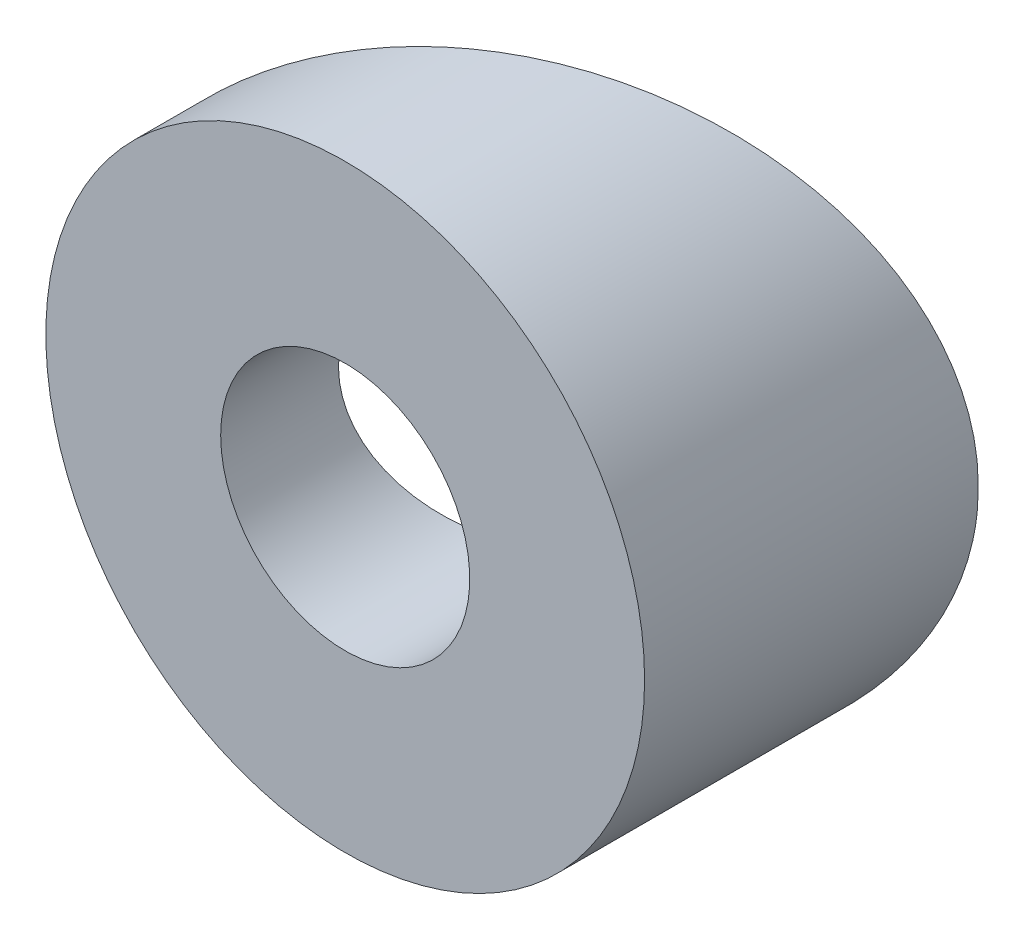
ISO-10303-21;
HEADER;
FILE_DESCRIPTION(('STEP AP214'),'2;1');
FILE_NAME('part.step','',(''),(''),'','','');
FILE_SCHEMA(('AUTOMOTIVE_DESIGN { 1 0 10303 214 1 1 1 1 }'));
ENDSEC;
DATA;
#1=APPLICATION_CONTEXT('core data for automotive mechanical design processes');
#2=APPLICATION_PROTOCOL_DEFINITION('international standard','automotive_design',2000,#1);
#3=PRODUCT_CONTEXT('',#1,'mechanical');
#4=PRODUCT('Part','Part','',(#3));
#5=PRODUCT_RELATED_PRODUCT_CATEGORY('part','',(#4));
#6=PRODUCT_DEFINITION_FORMATION('','',#4);
#7=PRODUCT_DEFINITION_CONTEXT('part definition',#1,'design');
#8=PRODUCT_DEFINITION('design','',#6,#7);
#9=PRODUCT_DEFINITION_SHAPE('','',#8);
#10=(LENGTH_UNIT() NAMED_UNIT(*) SI_UNIT(.MILLI.,.METRE.));
#11=(NAMED_UNIT(*) PLANE_ANGLE_UNIT() SI_UNIT($,.RADIAN.));
#12=(NAMED_UNIT(*) SI_UNIT($,.STERADIAN.) SOLID_ANGLE_UNIT());
#13=UNCERTAINTY_MEASURE_WITH_UNIT(LENGTH_MEASURE(1.E-05),#10,'distance_accuracy_value','');
#14=(GEOMETRIC_REPRESENTATION_CONTEXT(3) GLOBAL_UNCERTAINTY_ASSIGNED_CONTEXT((#13)) GLOBAL_UNIT_ASSIGNED_CONTEXT((#10,
#11,#12)) REPRESENTATION_CONTEXT('',''));
#15=CARTESIAN_POINT('',(0.,0.,0.));
#16=DIRECTION('',(0.,0.,1.));
#17=DIRECTION('',(1.,0.,0.));
#18=AXIS2_PLACEMENT_3D('',#15,#16,#17);
#19=CARTESIAN_POINT('',(0.,0.,0.));
#20=DIRECTION('',(0.,0.,-1.));
#21=DIRECTION('',(1.,0.,0.));
#22=AXIS2_PLACEMENT_3D('',#19,#20,#21);
#23=CYLINDRICAL_SURFACE('',#22,7.9375);
#24=CARTESIAN_POINT('',(0.,0.,3.27061794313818));
#25=DIRECTION('',(0.453990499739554,0.,0.891006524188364));
#26=DIRECTION('',(0.891006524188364,0.,-0.453990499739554));
#27=AXIS2_PLACEMENT_3D('',#24,#25,#26);
#28=ELLIPSE('',#27,8.90846451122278,7.9375);
#29=CARTESIAN_POINT('',(7.91445833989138,-0.604363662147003,-0.761999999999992));
#30=VERTEX_POINT('',#29);
#31=CARTESIAN_POINT('',(7.91445833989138,0.604363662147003,-0.761999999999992));
#32=VERTEX_POINT('',#31);
#33=EDGE_CURVE('E57',#30,#32,#28,.F.);
#34=ORIENTED_EDGE('',*,*,#33,.F.);
#35=CARTESIAN_POINT('',(0.,0.,-0.761999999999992));
#36=DIRECTION('',(0.,0.,1.));
#37=DIRECTION('',(1.,0.,0.));
#38=AXIS2_PLACEMENT_3D('',#35,#36,#37);
#39=CIRCLE('',#38,7.9375);
#40=EDGE_CURVE('E51',#30,#32,#39,.T.);
#41=ORIENTED_EDGE('',*,*,#40,.T.);
#42=EDGE_LOOP('',(#34,#41));
#43=FACE_BOUND('',#42,.T.);
#44=CARTESIAN_POINT('',(0.,0.,8.07720000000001));
#45=DIRECTION('',(0.,0.,-1.));
#46=DIRECTION('',(1.,0.,0.));
#47=AXIS2_PLACEMENT_3D('',#44,#45,#46);
#48=CIRCLE('',#47,7.9375);
#49=CARTESIAN_POINT('',(7.9375,0.,8.07720000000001));
#50=VERTEX_POINT('',#49);
#51=EDGE_CURVE('E12',#50,#50,#48,.T.);
#52=ORIENTED_EDGE('',*,*,#51,.T.);
#53=EDGE_LOOP('',(#52));
#54=FACE_BOUND('',#53,.T.);
#55=ADVANCED_FACE('F43',(#43,#54),#23,.T.);
#56=CARTESIAN_POINT('',(0.597787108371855,0.,8.07720000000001));
#57=DIRECTION('',(0.,0.,1.));
#58=DIRECTION('',(1.,0.,0.));
#59=AXIS2_PLACEMENT_3D('',#56,#57,#58);
#60=PLANE('',#59);
#61=CARTESIAN_POINT('',(0.,0.,8.07720000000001));
#62=DIRECTION('',(0.,0.,-1.));
#63=DIRECTION('',(-1.,0.,0.));
#64=AXIS2_PLACEMENT_3D('',#61,#62,#63);
#65=CIRCLE('',#64,3.30199999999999);
#66=CARTESIAN_POINT('',(-3.30199999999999,0.,8.07720000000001));
#67=VERTEX_POINT('',#66);
#68=EDGE_CURVE('E70',#67,#67,#65,.T.);
#69=ORIENTED_EDGE('',*,*,#68,.T.);
#70=EDGE_LOOP('',(#69));
#71=FACE_BOUND('',#70,.T.);
#72=ORIENTED_EDGE('',*,*,#51,.F.);
#73=EDGE_LOOP('',(#72));
#74=FACE_BOUND('',#73,.T.);
#75=ADVANCED_FACE('F88',(#71,#74),#60,.T.);
#76=CARTESIAN_POINT('',(0.,0.,-0.761999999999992));
#77=DIRECTION('',(0.,0.,1.));
#78=DIRECTION('',(1.,0.,0.));
#79=AXIS2_PLACEMENT_3D('',#76,#77,#78);
#80=PLANE('',#79);
#81=ORIENTED_EDGE('',*,*,#40,.F.);
#82=DIRECTION('',(0.,-1.,0.));
#83=VECTOR('',#82,1.);
#84=CARTESIAN_POINT('',(7.91445833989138,0.,-0.761999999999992));
#85=LINE('',#84,#83);
#86=EDGE_CURVE('E59',#32,#30,#85,.T.);
#87=ORIENTED_EDGE('',*,*,#86,.F.);
#88=EDGE_LOOP('',(#81,#87));
#89=FACE_BOUND('',#88,.T.);
#90=ADVANCED_FACE('F69',(#89),#80,.F.);
#91=CARTESIAN_POINT('',(0.,0.,-0.761999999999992));
#92=DIRECTION('',(0.,0.,-1.));
#93=DIRECTION('',(-1.,0.,0.));
#94=AXIS2_PLACEMENT_3D('',#91,#92,#93);
#95=CYLINDRICAL_SURFACE('',#94,3.30199999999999);
#96=CARTESIAN_POINT('',(0.,0.,3.27061794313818));
#97=DIRECTION('',(0.453990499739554,0.,0.891006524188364));
#98=DIRECTION('',(0.891006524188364,0.,-0.453990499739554));
#99=AXIS2_PLACEMENT_3D('',#96,#97,#98);
#100=ELLIPSE('',#99,3.70592123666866,3.30199999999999);
#101=CARTESIAN_POINT('',(3.30199999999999,0.,1.58816490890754));
#102=VERTEX_POINT('',#101);
#103=EDGE_CURVE('E46',#102,#102,#100,.F.);
#104=ORIENTED_EDGE('',*,*,#103,.T.);
#105=EDGE_LOOP('',(#104));
#106=FACE_BOUND('',#105,.T.);
#107=ORIENTED_EDGE('',*,*,#68,.F.);
#108=EDGE_LOOP('',(#107));
#109=FACE_BOUND('',#108,.T.);
#110=ADVANCED_FACE('F79',(#106,#109),#95,.F.);
#111=CARTESIAN_POINT('',(1.32299274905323,0.,2.59651946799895));
#112=DIRECTION('',(0.453990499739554,0.,0.891006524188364));
#113=DIRECTION('',(0.891006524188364,0.,-0.453990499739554));
#114=AXIS2_PLACEMENT_3D('',#111,#112,#113);
#115=PLANE('',#114);
#116=ORIENTED_EDGE('',*,*,#33,.T.);
#117=ORIENTED_EDGE('',*,*,#86,.T.);
#118=EDGE_LOOP('',(#116,#117));
#119=FACE_BOUND('',#118,.T.);
#120=ORIENTED_EDGE('',*,*,#103,.F.);
#121=EDGE_LOOP('',(#120));
#122=FACE_BOUND('',#121,.T.);
#123=ADVANCED_FACE('F60',(#119,#122),#115,.F.);
#124=CLOSED_SHELL('',(#55,#75,#90,#110,#123));
#125=MANIFOLD_SOLID_BREP('B2',#124);
#126=ADVANCED_BREP_SHAPE_REPRESENTATION('',(#18,#125),#14);
#127=SHAPE_DEFINITION_REPRESENTATION(#9,#126);
ENDSEC;
END-ISO-10303-21;
